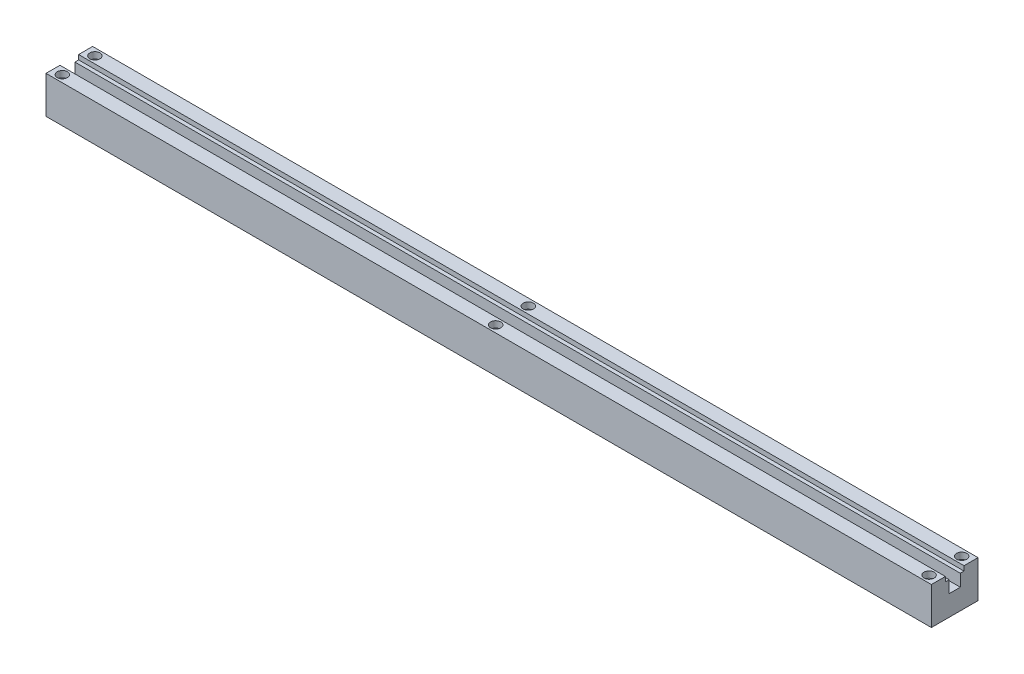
ISO-10303-21;
HEADER;
FILE_DESCRIPTION(('STEP AP214'),'2;1');
FILE_NAME('part.step','',(''),(''),'','','');
FILE_SCHEMA(('AUTOMOTIVE_DESIGN { 1 0 10303 214 1 1 1 1 }'));
ENDSEC;
DATA;
#1=APPLICATION_CONTEXT('core data for automotive mechanical design processes');
#2=APPLICATION_PROTOCOL_DEFINITION('international standard','automotive_design',2000,#1);
#3=PRODUCT_CONTEXT('',#1,'mechanical');
#4=PRODUCT('Part','Part','',(#3));
#5=PRODUCT_RELATED_PRODUCT_CATEGORY('part','',(#4));
#6=PRODUCT_DEFINITION_FORMATION('','',#4);
#7=PRODUCT_DEFINITION_CONTEXT('part definition',#1,'design');
#8=PRODUCT_DEFINITION('design','',#6,#7);
#9=PRODUCT_DEFINITION_SHAPE('','',#8);
#10=(LENGTH_UNIT() NAMED_UNIT(*) SI_UNIT(.MILLI.,.METRE.));
#11=(NAMED_UNIT(*) PLANE_ANGLE_UNIT() SI_UNIT($,.RADIAN.));
#12=(NAMED_UNIT(*) SI_UNIT($,.STERADIAN.) SOLID_ANGLE_UNIT());
#13=UNCERTAINTY_MEASURE_WITH_UNIT(LENGTH_MEASURE(1.E-05),#10,'distance_accuracy_value','');
#14=(GEOMETRIC_REPRESENTATION_CONTEXT(3) GLOBAL_UNCERTAINTY_ASSIGNED_CONTEXT((#13)) GLOBAL_UNIT_ASSIGNED_CONTEXT((#10,
#11,#12)) REPRESENTATION_CONTEXT('',''));
#15=CARTESIAN_POINT('',(0.,0.,0.));
#16=DIRECTION('',(0.,0.,1.));
#17=DIRECTION('',(1.,0.,0.));
#18=AXIS2_PLACEMENT_3D('',#15,#16,#17);
#19=CARTESIAN_POINT('',(10.,20.,17.5));
#20=DIRECTION('',(0.,1.,0.));
#21=DIRECTION('',(0.,0.,1.));
#22=AXIS2_PLACEMENT_3D('',#19,#20,#21);
#23=CYLINDRICAL_SURFACE('',#22,5.49999999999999);
#24=CARTESIAN_POINT('',(10.,13.2,17.5));
#25=DIRECTION('',(0.,1.,0.));
#26=DIRECTION('',(0.,0.,1.));
#27=AXIS2_PLACEMENT_3D('',#24,#25,#26);
#28=CIRCLE('',#27,5.49999999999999);
#29=CARTESIAN_POINT('',(10.,13.2,23.));
#30=VERTEX_POINT('',#29);
#31=EDGE_CURVE('E223',#30,#30,#28,.F.);
#32=ORIENTED_EDGE('',*,*,#31,.T.);
#33=EDGE_LOOP('',(#32));
#34=FACE_BOUND('',#33,.T.);
#35=CARTESIAN_POINT('',(10.,20.,17.5));
#36=DIRECTION('',(0.,1.,0.));
#37=DIRECTION('',(0.,0.,1.));
#38=AXIS2_PLACEMENT_3D('',#35,#36,#37);
#39=CIRCLE('',#38,5.49999999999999);
#40=CARTESIAN_POINT('',(10.,20.,23.));
#41=VERTEX_POINT('',#40);
#42=EDGE_CURVE('E158',#41,#41,#39,.T.);
#43=ORIENTED_EDGE('',*,*,#42,.T.);
#44=EDGE_LOOP('',(#43));
#45=FACE_BOUND('',#44,.T.);
#46=ADVANCED_FACE('F17',(#34,#45),#23,.F.);
#47=CARTESIAN_POINT('',(475.,20.,17.4999999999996));
#48=DIRECTION('',(0.,1.,0.));
#49=DIRECTION('',(0.,0.,1.));
#50=AXIS2_PLACEMENT_3D('',#47,#48,#49);
#51=CYLINDRICAL_SURFACE('',#50,5.50000000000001);
#52=CARTESIAN_POINT('',(475.,13.2,17.4999999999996));
#53=DIRECTION('',(0.,1.,0.));
#54=DIRECTION('',(0.,0.,1.));
#55=AXIS2_PLACEMENT_3D('',#52,#53,#54);
#56=CIRCLE('',#55,5.50000000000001);
#57=CARTESIAN_POINT('',(475.,13.2,22.9999999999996));
#58=VERTEX_POINT('',#57);
#59=EDGE_CURVE('E218',#58,#58,#56,.F.);
#60=ORIENTED_EDGE('',*,*,#59,.T.);
#61=EDGE_LOOP('',(#60));
#62=FACE_BOUND('',#61,.T.);
#63=CARTESIAN_POINT('',(475.,20.,17.4999999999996));
#64=DIRECTION('',(0.,1.,0.));
#65=DIRECTION('',(0.,0.,1.));
#66=AXIS2_PLACEMENT_3D('',#63,#64,#65);
#67=CIRCLE('',#66,5.50000000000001);
#68=CARTESIAN_POINT('',(475.,20.,22.9999999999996));
#69=VERTEX_POINT('',#68);
#70=EDGE_CURVE('E208',#69,#69,#67,.T.);
#71=ORIENTED_EDGE('',*,*,#70,.T.);
#72=EDGE_LOOP('',(#71));
#73=FACE_BOUND('',#72,.T.);
#74=ADVANCED_FACE('F325',(#62,#73),#51,.F.);
#75=CARTESIAN_POINT('',(940.,20.,17.5));
#76=DIRECTION('',(0.,1.,0.));
#77=DIRECTION('',(0.,0.,1.));
#78=AXIS2_PLACEMENT_3D('',#75,#76,#77);
#79=CYLINDRICAL_SURFACE('',#78,5.49999999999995);
#80=CARTESIAN_POINT('',(940.,13.2,17.5));
#81=DIRECTION('',(0.,1.,0.));
#82=DIRECTION('',(0.,0.,1.));
#83=AXIS2_PLACEMENT_3D('',#80,#81,#82);
#84=CIRCLE('',#83,5.49999999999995);
#85=CARTESIAN_POINT('',(940.,13.2,22.9999999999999));
#86=VERTEX_POINT('',#85);
#87=EDGE_CURVE('E215',#86,#86,#84,.F.);
#88=ORIENTED_EDGE('',*,*,#87,.T.);
#89=EDGE_LOOP('',(#88));
#90=FACE_BOUND('',#89,.T.);
#91=CARTESIAN_POINT('',(940.,20.,17.5));
#92=DIRECTION('',(0.,1.,0.));
#93=DIRECTION('',(0.,0.,1.));
#94=AXIS2_PLACEMENT_3D('',#91,#92,#93);
#95=CIRCLE('',#94,5.49999999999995);
#96=CARTESIAN_POINT('',(940.,20.,22.9999999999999));
#97=VERTEX_POINT('',#96);
#98=EDGE_CURVE('E154',#97,#97,#95,.T.);
#99=ORIENTED_EDGE('',*,*,#98,.T.);
#100=EDGE_LOOP('',(#99));
#101=FACE_BOUND('',#100,.T.);
#102=ADVANCED_FACE('F323',(#90,#101),#79,.F.);
#103=CARTESIAN_POINT('',(10.,20.,-17.5));
#104=DIRECTION('',(0.,1.,0.));
#105=DIRECTION('',(0.,0.,1.));
#106=AXIS2_PLACEMENT_3D('',#103,#104,#105);
#107=CYLINDRICAL_SURFACE('',#106,5.49999999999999);
#108=CARTESIAN_POINT('',(10.,13.2,-17.5));
#109=DIRECTION('',(0.,1.,0.));
#110=DIRECTION('',(0.,0.,1.));
#111=AXIS2_PLACEMENT_3D('',#108,#109,#110);
#112=CIRCLE('',#111,5.49999999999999);
#113=CARTESIAN_POINT('',(10.,13.2,-12.));
#114=VERTEX_POINT('',#113);
#115=EDGE_CURVE('E20',#114,#114,#112,.F.);
#116=ORIENTED_EDGE('',*,*,#115,.T.);
#117=EDGE_LOOP('',(#116));
#118=FACE_BOUND('',#117,.T.);
#119=CARTESIAN_POINT('',(10.,20.,-17.5));
#120=DIRECTION('',(0.,1.,0.));
#121=DIRECTION('',(0.,0.,1.));
#122=AXIS2_PLACEMENT_3D('',#119,#120,#121);
#123=CIRCLE('',#122,5.49999999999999);
#124=CARTESIAN_POINT('',(10.,20.,-12.));
#125=VERTEX_POINT('',#124);
#126=EDGE_CURVE('E153',#125,#125,#123,.T.);
#127=ORIENTED_EDGE('',*,*,#126,.T.);
#128=EDGE_LOOP('',(#127));
#129=FACE_BOUND('',#128,.T.);
#130=ADVANCED_FACE('F230',(#118,#129),#107,.F.);
#131=CARTESIAN_POINT('',(475.,20.,-17.5000000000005));
#132=DIRECTION('',(0.,1.,0.));
#133=DIRECTION('',(0.,0.,1.));
#134=AXIS2_PLACEMENT_3D('',#131,#132,#133);
#135=CYLINDRICAL_SURFACE('',#134,5.50000000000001);
#136=CARTESIAN_POINT('',(475.,13.2,-17.5000000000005));
#137=DIRECTION('',(0.,1.,0.));
#138=DIRECTION('',(0.,0.,1.));
#139=AXIS2_PLACEMENT_3D('',#136,#137,#138);
#140=CIRCLE('',#139,5.50000000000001);
#141=CARTESIAN_POINT('',(475.,13.2,-12.0000000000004));
#142=VERTEX_POINT('',#141);
#143=EDGE_CURVE('E221',#142,#142,#140,.F.);
#144=ORIENTED_EDGE('',*,*,#143,.T.);
#145=EDGE_LOOP('',(#144));
#146=FACE_BOUND('',#145,.T.);
#147=CARTESIAN_POINT('',(475.,20.,-17.5000000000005));
#148=DIRECTION('',(0.,1.,0.));
#149=DIRECTION('',(0.,0.,1.));
#150=AXIS2_PLACEMENT_3D('',#147,#148,#149);
#151=CIRCLE('',#150,5.50000000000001);
#152=CARTESIAN_POINT('',(475.,20.,-12.0000000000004));
#153=VERTEX_POINT('',#152);
#154=EDGE_CURVE('E201',#153,#153,#151,.T.);
#155=ORIENTED_EDGE('',*,*,#154,.T.);
#156=EDGE_LOOP('',(#155));
#157=FACE_BOUND('',#156,.T.);
#158=ADVANCED_FACE('F316',(#146,#157),#135,.F.);
#159=CARTESIAN_POINT('',(940.,20.,-17.5));
#160=DIRECTION('',(0.,1.,0.));
#161=DIRECTION('',(0.,0.,1.));
#162=AXIS2_PLACEMENT_3D('',#159,#160,#161);
#163=CYLINDRICAL_SURFACE('',#162,5.49999999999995);
#164=CARTESIAN_POINT('',(940.,13.2,-17.5));
#165=DIRECTION('',(0.,1.,0.));
#166=DIRECTION('',(0.,0.,1.));
#167=AXIS2_PLACEMENT_3D('',#164,#165,#166);
#168=CIRCLE('',#167,5.49999999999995);
#169=CARTESIAN_POINT('',(940.,13.2,-12.0000000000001));
#170=VERTEX_POINT('',#169);
#171=EDGE_CURVE('E162',#170,#170,#168,.F.);
#172=ORIENTED_EDGE('',*,*,#171,.T.);
#173=EDGE_LOOP('',(#172));
#174=FACE_BOUND('',#173,.T.);
#175=CARTESIAN_POINT('',(940.,20.,-17.5));
#176=DIRECTION('',(0.,1.,0.));
#177=DIRECTION('',(0.,0.,1.));
#178=AXIS2_PLACEMENT_3D('',#175,#176,#177);
#179=CIRCLE('',#178,5.49999999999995);
#180=CARTESIAN_POINT('',(940.,20.,-12.0000000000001));
#181=VERTEX_POINT('',#180);
#182=EDGE_CURVE('E149',#181,#181,#179,.T.);
#183=ORIENTED_EDGE('',*,*,#182,.T.);
#184=EDGE_LOOP('',(#183));
#185=FACE_BOUND('',#184,.T.);
#186=ADVANCED_FACE('F237',(#174,#185),#163,.F.);
#187=CARTESIAN_POINT('',(13.2,13.2,-17.5));
#188=DIRECTION('',(0.,-1.,0.));
#189=DIRECTION('',(0.,0.,-1.));
#190=AXIS2_PLACEMENT_3D('',#187,#188,#189);
#191=PLANE('',#190);
#192=ORIENTED_EDGE('',*,*,#115,.F.);
#193=EDGE_LOOP('',(#192));
#194=FACE_BOUND('',#193,.T.);
#195=CARTESIAN_POINT('',(10.,13.2,-17.5));
#196=DIRECTION('',(0.,1.,0.));
#197=DIRECTION('',(0.,0.,1.));
#198=AXIS2_PLACEMENT_3D('',#195,#196,#197);
#199=CIRCLE('',#198,3.2);
#200=CARTESIAN_POINT('',(10.,13.2,-14.3));
#201=VERTEX_POINT('',#200);
#202=EDGE_CURVE('E127',#201,#201,#199,.F.);
#203=ORIENTED_EDGE('',*,*,#202,.T.);
#204=EDGE_LOOP('',(#203));
#205=FACE_BOUND('',#204,.T.);
#206=ADVANCED_FACE('F233',(#194,#205),#191,.F.);
#207=CARTESIAN_POINT('',(13.2,13.2,17.5));
#208=DIRECTION('',(0.,-1.,0.));
#209=DIRECTION('',(0.,0.,-1.));
#210=AXIS2_PLACEMENT_3D('',#207,#208,#209);
#211=PLANE('',#210);
#212=ORIENTED_EDGE('',*,*,#31,.F.);
#213=EDGE_LOOP('',(#212));
#214=FACE_BOUND('',#213,.T.);
#215=CARTESIAN_POINT('',(10.,13.2,17.5));
#216=DIRECTION('',(0.,1.,0.));
#217=DIRECTION('',(0.,0.,1.));
#218=AXIS2_PLACEMENT_3D('',#215,#216,#217);
#219=CIRCLE('',#218,3.2);
#220=CARTESIAN_POINT('',(10.,13.2,20.7));
#221=VERTEX_POINT('',#220);
#222=EDGE_CURVE('E194',#221,#221,#219,.F.);
#223=ORIENTED_EDGE('',*,*,#222,.T.);
#224=EDGE_LOOP('',(#223));
#225=FACE_BOUND('',#224,.T.);
#226=ADVANCED_FACE('F236',(#214,#225),#211,.F.);
#227=CARTESIAN_POINT('',(478.2,13.2,-17.5000000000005));
#228=DIRECTION('',(0.,-1.,0.));
#229=DIRECTION('',(0.,0.,-1.));
#230=AXIS2_PLACEMENT_3D('',#227,#228,#229);
#231=PLANE('',#230);
#232=ORIENTED_EDGE('',*,*,#143,.F.);
#233=EDGE_LOOP('',(#232));
#234=FACE_BOUND('',#233,.T.);
#235=CARTESIAN_POINT('',(475.,13.2,-17.5000000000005));
#236=DIRECTION('',(0.,1.,0.));
#237=DIRECTION('',(0.,0.,1.));
#238=AXIS2_PLACEMENT_3D('',#235,#236,#237);
#239=CIRCLE('',#238,3.20000000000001);
#240=CARTESIAN_POINT('',(475.,13.2,-14.3000000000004));
#241=VERTEX_POINT('',#240);
#242=EDGE_CURVE('E191',#241,#241,#239,.F.);
#243=ORIENTED_EDGE('',*,*,#242,.T.);
#244=EDGE_LOOP('',(#243));
#245=FACE_BOUND('',#244,.T.);
#246=ADVANCED_FACE('F297',(#234,#245),#231,.F.);
#247=CARTESIAN_POINT('',(478.2,13.2,17.4999999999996));
#248=DIRECTION('',(0.,-1.,0.));
#249=DIRECTION('',(0.,0.,-1.));
#250=AXIS2_PLACEMENT_3D('',#247,#248,#249);
#251=PLANE('',#250);
#252=ORIENTED_EDGE('',*,*,#59,.F.);
#253=EDGE_LOOP('',(#252));
#254=FACE_BOUND('',#253,.T.);
#255=CARTESIAN_POINT('',(475.,13.2,17.4999999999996));
#256=DIRECTION('',(0.,1.,0.));
#257=DIRECTION('',(0.,0.,1.));
#258=AXIS2_PLACEMENT_3D('',#255,#256,#257);
#259=CIRCLE('',#258,3.20000000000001);
#260=CARTESIAN_POINT('',(475.,13.2,20.6999999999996));
#261=VERTEX_POINT('',#260);
#262=EDGE_CURVE('E188',#261,#261,#259,.F.);
#263=ORIENTED_EDGE('',*,*,#262,.T.);
#264=EDGE_LOOP('',(#263));
#265=FACE_BOUND('',#264,.T.);
#266=ADVANCED_FACE('F299',(#254,#265),#251,.F.);
#267=CARTESIAN_POINT('',(943.2,13.2,17.5));
#268=DIRECTION('',(0.,-1.,0.));
#269=DIRECTION('',(0.,0.,-1.));
#270=AXIS2_PLACEMENT_3D('',#267,#268,#269);
#271=PLANE('',#270);
#272=ORIENTED_EDGE('',*,*,#87,.F.);
#273=EDGE_LOOP('',(#272));
#274=FACE_BOUND('',#273,.T.);
#275=CARTESIAN_POINT('',(940.,13.2,17.5));
#276=DIRECTION('',(0.,1.,0.));
#277=DIRECTION('',(0.,0.,1.));
#278=AXIS2_PLACEMENT_3D('',#275,#276,#277);
#279=CIRCLE('',#278,3.19999999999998);
#280=CARTESIAN_POINT('',(940.,13.2,20.7));
#281=VERTEX_POINT('',#280);
#282=EDGE_CURVE('E185',#281,#281,#279,.F.);
#283=ORIENTED_EDGE('',*,*,#282,.T.);
#284=EDGE_LOOP('',(#283));
#285=FACE_BOUND('',#284,.T.);
#286=ADVANCED_FACE('F306',(#274,#285),#271,.F.);
#287=CARTESIAN_POINT('',(943.2,13.2,-17.5));
#288=DIRECTION('',(0.,-1.,0.));
#289=DIRECTION('',(0.,0.,-1.));
#290=AXIS2_PLACEMENT_3D('',#287,#288,#289);
#291=PLANE('',#290);
#292=ORIENTED_EDGE('',*,*,#171,.F.);
#293=EDGE_LOOP('',(#292));
#294=FACE_BOUND('',#293,.T.);
#295=CARTESIAN_POINT('',(940.,13.2,-17.5));
#296=DIRECTION('',(0.,1.,0.));
#297=DIRECTION('',(0.,0.,1.));
#298=AXIS2_PLACEMENT_3D('',#295,#296,#297);
#299=CIRCLE('',#298,3.19999999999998);
#300=CARTESIAN_POINT('',(940.,13.2,-14.3));
#301=VERTEX_POINT('',#300);
#302=EDGE_CURVE('E139',#301,#301,#299,.F.);
#303=ORIENTED_EDGE('',*,*,#302,.T.);
#304=EDGE_LOOP('',(#303));
#305=FACE_BOUND('',#304,.T.);
#306=ADVANCED_FACE('F364',(#294,#305),#291,.F.);
#307=CARTESIAN_POINT('',(0.,28.,6.));
#308=DIRECTION('',(0.,0.,1.));
#309=DIRECTION('',(1.,0.,0.));
#310=AXIS2_PLACEMENT_3D('',#307,#308,#309);
#311=PLANE('',#310);
#312=DIRECTION('',(1.,0.,0.));
#313=VECTOR('',#312,1.);
#314=CARTESIAN_POINT('',(0.,2.,6.));
#315=LINE('',#314,#313);
#316=CARTESIAN_POINT('',(950.,2.,6.));
#317=VERTEX_POINT('',#316);
#318=CARTESIAN_POINT('',(0.,2.,6.));
#319=VERTEX_POINT('',#318);
#320=EDGE_CURVE('E128',#317,#319,#315,.F.);
#321=ORIENTED_EDGE('',*,*,#320,.T.);
#322=DIRECTION('',(0.,1.,0.));
#323=VECTOR('',#322,1.);
#324=CARTESIAN_POINT('',(0.,0.,6.));
#325=LINE('',#324,#323);
#326=CARTESIAN_POINT('',(0.,15.,6.));
#327=VERTEX_POINT('',#326);
#328=EDGE_CURVE('E668',#319,#327,#325,.T.);
#329=ORIENTED_EDGE('',*,*,#328,.T.);
#330=DIRECTION('',(1.,0.,0.));
#331=VECTOR('',#330,1.);
#332=CARTESIAN_POINT('',(0.,15.,6.));
#333=LINE('',#332,#331);
#334=CARTESIAN_POINT('',(950.,15.,6.));
#335=VERTEX_POINT('',#334);
#336=EDGE_CURVE('E159',#327,#335,#333,.T.);
#337=ORIENTED_EDGE('',*,*,#336,.T.);
#338=DIRECTION('',(0.,1.,0.));
#339=VECTOR('',#338,1.);
#340=CARTESIAN_POINT('',(950.,0.,6.));
#341=LINE('',#340,#339);
#342=EDGE_CURVE('E132',#317,#335,#341,.T.);
#343=ORIENTED_EDGE('',*,*,#342,.F.);
#344=EDGE_LOOP('',(#321,#329,#337,#343));
#345=FACE_BOUND('',#344,.T.);
#346=ADVANCED_FACE('F360',(#345),#311,.F.);
#347=CARTESIAN_POINT('',(0.,15.,10.));
#348=DIRECTION('',(0.,-1.,0.));
#349=DIRECTION('',(0.,0.,-1.));
#350=AXIS2_PLACEMENT_3D('',#347,#348,#349);
#351=PLANE('',#350);
#352=ORIENTED_EDGE('',*,*,#336,.F.);
#353=DIRECTION('',(0.,0.,-1.));
#354=VECTOR('',#353,1.);
#355=CARTESIAN_POINT('',(0.,15.,0.));
#356=LINE('',#355,#354);
#357=CARTESIAN_POINT('',(0.,15.,10.));
#358=VERTEX_POINT('',#357);
#359=EDGE_CURVE('E634',#327,#358,#356,.F.);
#360=ORIENTED_EDGE('',*,*,#359,.T.);
#361=DIRECTION('',(1.,0.,0.));
#362=VECTOR('',#361,1.);
#363=CARTESIAN_POINT('',(0.,15.,10.));
#364=LINE('',#363,#362);
#365=CARTESIAN_POINT('',(950.,15.,10.));
#366=VERTEX_POINT('',#365);
#367=EDGE_CURVE('E155',#358,#366,#364,.T.);
#368=ORIENTED_EDGE('',*,*,#367,.T.);
#369=DIRECTION('',(0.,0.,-1.));
#370=VECTOR('',#369,1.);
#371=CARTESIAN_POINT('',(950.,15.,0.));
#372=LINE('',#371,#370);
#373=EDGE_CURVE('E134',#335,#366,#372,.F.);
#374=ORIENTED_EDGE('',*,*,#373,.F.);
#375=EDGE_LOOP('',(#352,#360,#368,#374));
#376=FACE_BOUND('',#375,.T.);
#377=ADVANCED_FACE('F352',(#376),#351,.F.);
#378=CARTESIAN_POINT('',(0.,25.,10.));
#379=DIRECTION('',(0.,0.,1.));
#380=DIRECTION('',(0.,-1.,0.));
#381=AXIS2_PLACEMENT_3D('',#378,#379,#380);
#382=PLANE('',#381);
#383=ORIENTED_EDGE('',*,*,#367,.F.);
#384=DIRECTION('',(0.,1.,0.));
#385=VECTOR('',#384,1.);
#386=CARTESIAN_POINT('',(0.,0.,10.));
#387=LINE('',#386,#385);
#388=CARTESIAN_POINT('',(0.,20.,10.));
#389=VERTEX_POINT('',#388);
#390=EDGE_CURVE('E638',#358,#389,#387,.T.);
#391=ORIENTED_EDGE('',*,*,#390,.T.);
#392=DIRECTION('',(1.,0.,0.));
#393=VECTOR('',#392,1.);
#394=CARTESIAN_POINT('',(950.,20.,10.));
#395=LINE('',#394,#393);
#396=CARTESIAN_POINT('',(950.,20.,10.));
#397=VERTEX_POINT('',#396);
#398=EDGE_CURVE('E150',#389,#397,#395,.T.);
#399=ORIENTED_EDGE('',*,*,#398,.T.);
#400=DIRECTION('',(0.,1.,0.));
#401=VECTOR('',#400,1.);
#402=CARTESIAN_POINT('',(950.,0.,10.));
#403=LINE('',#402,#401);
#404=EDGE_CURVE('E629',#366,#397,#403,.T.);
#405=ORIENTED_EDGE('',*,*,#404,.F.);
#406=EDGE_LOOP('',(#383,#391,#399,#405));
#407=FACE_BOUND('',#406,.T.);
#408=ADVANCED_FACE('F340',(#407),#382,.F.);
#409=CARTESIAN_POINT('',(950.,20.,25.));
#410=DIRECTION('',(0.,-1.,0.));
#411=DIRECTION('',(0.,0.,-1.));
#412=AXIS2_PLACEMENT_3D('',#409,#410,#411);
#413=PLANE('',#412);
#414=ORIENTED_EDGE('',*,*,#398,.F.);
#415=DIRECTION('',(0.,0.,-1.));
#416=VECTOR('',#415,1.);
#417=CARTESIAN_POINT('',(0.,20.,0.));
#418=LINE('',#417,#416);
#419=CARTESIAN_POINT('',(0.,20.,25.));
#420=VERTEX_POINT('',#419);
#421=EDGE_CURVE('E664',#389,#420,#418,.F.);
#422=ORIENTED_EDGE('',*,*,#421,.T.);
#423=DIRECTION('',(-1.,0.,0.));
#424=VECTOR('',#423,1.);
#425=CARTESIAN_POINT('',(950.,20.,25.));
#426=LINE('',#425,#424);
#427=CARTESIAN_POINT('',(950.,20.,25.));
#428=VERTEX_POINT('',#427);
#429=EDGE_CURVE('E117',#420,#428,#426,.F.);
#430=ORIENTED_EDGE('',*,*,#429,.T.);
#431=DIRECTION('',(0.,0.,-1.));
#432=VECTOR('',#431,1.);
#433=CARTESIAN_POINT('',(950.,20.,0.));
#434=LINE('',#433,#432);
#435=EDGE_CURVE('E627',#397,#428,#434,.F.);
#436=ORIENTED_EDGE('',*,*,#435,.F.);
#437=EDGE_LOOP('',(#414,#422,#430,#436));
#438=FACE_BOUND('',#437,.T.);
#439=ORIENTED_EDGE('',*,*,#98,.F.);
#440=EDGE_LOOP('',(#439));
#441=FACE_BOUND('',#440,.T.);
#442=ORIENTED_EDGE('',*,*,#70,.F.);
#443=EDGE_LOOP('',(#442));
#444=FACE_BOUND('',#443,.T.);
#445=ORIENTED_EDGE('',*,*,#42,.F.);
#446=EDGE_LOOP('',(#445));
#447=FACE_BOUND('',#446,.T.);
#448=ADVANCED_FACE('F336',(#438,#441,#444,#447),#413,.F.);
#449=CARTESIAN_POINT('',(950.,20.,25.));
#450=DIRECTION('',(0.,-1.,0.));
#451=DIRECTION('',(0.,0.,-1.));
#452=AXIS2_PLACEMENT_3D('',#449,#450,#451);
#453=PLANE('',#452);
#454=DIRECTION('',(-1.,0.,0.));
#455=VECTOR('',#454,1.);
#456=CARTESIAN_POINT('',(0.,20.,-10.));
#457=LINE('',#456,#455);
#458=CARTESIAN_POINT('',(0.,20.,-10.));
#459=VERTEX_POINT('',#458);
#460=CARTESIAN_POINT('',(950.,20.,-10.));
#461=VERTEX_POINT('',#460);
#462=EDGE_CURVE('E146',#459,#461,#457,.F.);
#463=ORIENTED_EDGE('',*,*,#462,.T.);
#464=DIRECTION('',(0.,0.,-1.));
#465=VECTOR('',#464,1.);
#466=CARTESIAN_POINT('',(950.,20.,0.));
#467=LINE('',#466,#465);
#468=CARTESIAN_POINT('',(950.,20.,-25.));
#469=VERTEX_POINT('',#468);
#470=EDGE_CURVE('E620',#469,#461,#467,.F.);
#471=ORIENTED_EDGE('',*,*,#470,.F.);
#472=DIRECTION('',(1.,0.,0.));
#473=VECTOR('',#472,1.);
#474=CARTESIAN_POINT('',(950.,20.,-25.));
#475=LINE('',#474,#473);
#476=CARTESIAN_POINT('',(0.,20.,-25.));
#477=VERTEX_POINT('',#476);
#478=EDGE_CURVE('E618',#469,#477,#475,.F.);
#479=ORIENTED_EDGE('',*,*,#478,.T.);
#480=DIRECTION('',(0.,0.,-1.));
#481=VECTOR('',#480,1.);
#482=CARTESIAN_POINT('',(0.,20.,0.));
#483=LINE('',#482,#481);
#484=EDGE_CURVE('E659',#477,#459,#483,.F.);
#485=ORIENTED_EDGE('',*,*,#484,.T.);
#486=EDGE_LOOP('',(#463,#471,#479,#485));
#487=FACE_BOUND('',#486,.T.);
#488=ORIENTED_EDGE('',*,*,#182,.F.);
#489=EDGE_LOOP('',(#488));
#490=FACE_BOUND('',#489,.T.);
#491=ORIENTED_EDGE('',*,*,#154,.F.);
#492=EDGE_LOOP('',(#491));
#493=FACE_BOUND('',#492,.T.);
#494=ORIENTED_EDGE('',*,*,#126,.F.);
#495=EDGE_LOOP('',(#494));
#496=FACE_BOUND('',#495,.T.);
#497=ADVANCED_FACE('F339',(#487,#490,#493,#496),#453,.F.);
#498=CARTESIAN_POINT('',(0.,25.,-10.));
#499=DIRECTION('',(0.,0.,-1.));
#500=DIRECTION('',(-1.,0.,0.));
#501=AXIS2_PLACEMENT_3D('',#498,#499,#500);
#502=PLANE('',#501);
#503=DIRECTION('',(1.,0.,0.));
#504=VECTOR('',#503,1.);
#505=CARTESIAN_POINT('',(0.,15.,-10.));
#506=LINE('',#505,#504);
#507=CARTESIAN_POINT('',(0.,15.,-10.));
#508=VERTEX_POINT('',#507);
#509=CARTESIAN_POINT('',(950.,15.,-10.));
#510=VERTEX_POINT('',#509);
#511=EDGE_CURVE('E143',#508,#510,#506,.T.);
#512=ORIENTED_EDGE('',*,*,#511,.T.);
#513=DIRECTION('',(0.,1.,0.));
#514=VECTOR('',#513,1.);
#515=CARTESIAN_POINT('',(950.,0.,-10.));
#516=LINE('',#515,#514);
#517=EDGE_CURVE('E611',#461,#510,#516,.F.);
#518=ORIENTED_EDGE('',*,*,#517,.F.);
#519=ORIENTED_EDGE('',*,*,#462,.F.);
#520=DIRECTION('',(0.,1.,0.));
#521=VECTOR('',#520,1.);
#522=CARTESIAN_POINT('',(0.,0.,-10.));
#523=LINE('',#522,#521);
#524=EDGE_CURVE('E613',#459,#508,#523,.F.);
#525=ORIENTED_EDGE('',*,*,#524,.T.);
#526=EDGE_LOOP('',(#512,#518,#519,#525));
#527=FACE_BOUND('',#526,.T.);
#528=ADVANCED_FACE('F349',(#527),#502,.F.);
#529=CARTESIAN_POINT('',(0.,15.,10.));
#530=DIRECTION('',(0.,-1.,0.));
#531=DIRECTION('',(0.,0.,-1.));
#532=AXIS2_PLACEMENT_3D('',#529,#530,#531);
#533=PLANE('',#532);
#534=DIRECTION('',(1.,0.,0.));
#535=VECTOR('',#534,1.);
#536=CARTESIAN_POINT('',(0.,15.,-6.));
#537=LINE('',#536,#535);
#538=CARTESIAN_POINT('',(0.,15.,-6.));
#539=VERTEX_POINT('',#538);
#540=CARTESIAN_POINT('',(950.,15.,-6.));
#541=VERTEX_POINT('',#540);
#542=EDGE_CURVE('E103',#539,#541,#537,.T.);
#543=ORIENTED_EDGE('',*,*,#542,.T.);
#544=DIRECTION('',(0.,0.,-1.));
#545=VECTOR('',#544,1.);
#546=CARTESIAN_POINT('',(950.,15.,0.));
#547=LINE('',#546,#545);
#548=EDGE_CURVE('E115',#510,#541,#547,.F.);
#549=ORIENTED_EDGE('',*,*,#548,.F.);
#550=ORIENTED_EDGE('',*,*,#511,.F.);
#551=DIRECTION('',(0.,0.,-1.));
#552=VECTOR('',#551,1.);
#553=CARTESIAN_POINT('',(0.,15.,0.));
#554=LINE('',#553,#552);
#555=EDGE_CURVE('E656',#508,#539,#554,.F.);
#556=ORIENTED_EDGE('',*,*,#555,.T.);
#557=EDGE_LOOP('',(#543,#549,#550,#556));
#558=FACE_BOUND('',#557,.T.);
#559=ADVANCED_FACE('F420',(#558),#533,.F.);
#560=CARTESIAN_POINT('',(0.,28.,-6.));
#561=DIRECTION('',(0.,0.,-1.));
#562=DIRECTION('',(0.,1.,0.));
#563=AXIS2_PLACEMENT_3D('',#560,#561,#562);
#564=PLANE('',#563);
#565=DIRECTION('',(1.,0.,0.));
#566=VECTOR('',#565,1.);
#567=CARTESIAN_POINT('',(0.,2.,-6.));
#568=LINE('',#567,#566);
#569=CARTESIAN_POINT('',(0.,2.,-6.));
#570=VERTEX_POINT('',#569);
#571=CARTESIAN_POINT('',(950.,2.,-6.));
#572=VERTEX_POINT('',#571);
#573=EDGE_CURVE('E120',#570,#572,#568,.T.);
#574=ORIENTED_EDGE('',*,*,#573,.T.);
#575=DIRECTION('',(0.,1.,0.));
#576=VECTOR('',#575,1.);
#577=CARTESIAN_POINT('',(950.,0.,-6.));
#578=LINE('',#577,#576);
#579=EDGE_CURVE('E109',#541,#572,#578,.F.);
#580=ORIENTED_EDGE('',*,*,#579,.F.);
#581=ORIENTED_EDGE('',*,*,#542,.F.);
#582=DIRECTION('',(0.,1.,0.));
#583=VECTOR('',#582,1.);
#584=CARTESIAN_POINT('',(0.,0.,-6.));
#585=LINE('',#584,#583);
#586=EDGE_CURVE('E123',#539,#570,#585,.F.);
#587=ORIENTED_EDGE('',*,*,#586,.T.);
#588=EDGE_LOOP('',(#574,#580,#581,#587));
#589=FACE_BOUND('',#588,.T.);
#590=ADVANCED_FACE('F121',(#589),#564,.F.);
#591=CARTESIAN_POINT('',(0.,2.,6.));
#592=DIRECTION('',(0.,-1.,0.));
#593=DIRECTION('',(0.,0.,-1.));
#594=AXIS2_PLACEMENT_3D('',#591,#592,#593);
#595=PLANE('',#594);
#596=ORIENTED_EDGE('',*,*,#573,.F.);
#597=DIRECTION('',(0.,0.,-1.));
#598=VECTOR('',#597,1.);
#599=CARTESIAN_POINT('',(0.,2.,0.));
#600=LINE('',#599,#598);
#601=EDGE_CURVE('E182',#570,#319,#600,.F.);
#602=ORIENTED_EDGE('',*,*,#601,.T.);
#603=ORIENTED_EDGE('',*,*,#320,.F.);
#604=DIRECTION('',(0.,0.,-1.));
#605=VECTOR('',#604,1.);
#606=CARTESIAN_POINT('',(950.,2.,0.));
#607=LINE('',#606,#605);
#608=EDGE_CURVE('E113',#572,#317,#607,.F.);
#609=ORIENTED_EDGE('',*,*,#608,.F.);
#610=EDGE_LOOP('',(#596,#602,#603,#609));
#611=FACE_BOUND('',#610,.T.);
#612=ADVANCED_FACE('F130',(#611),#595,.F.);
#613=CARTESIAN_POINT('',(10.,20.,-17.5));
#614=DIRECTION('',(0.,1.,0.));
#615=DIRECTION('',(0.,0.,1.));
#616=AXIS2_PLACEMENT_3D('',#613,#614,#615);
#617=CYLINDRICAL_SURFACE('',#616,3.2);
#618=CARTESIAN_POINT('',(10.,-20.,-17.5));
#619=DIRECTION('',(0.,1.,0.));
#620=DIRECTION('',(0.,0.,1.));
#621=AXIS2_PLACEMENT_3D('',#618,#619,#620);
#622=CIRCLE('',#621,3.2);
#623=CARTESIAN_POINT('',(10.,-20.,-14.3));
#624=VERTEX_POINT('',#623);
#625=EDGE_CURVE('E179',#624,#624,#622,.F.);
#626=ORIENTED_EDGE('',*,*,#625,.T.);
#627=EDGE_LOOP('',(#626));
#628=FACE_BOUND('',#627,.T.);
#629=ORIENTED_EDGE('',*,*,#202,.F.);
#630=EDGE_LOOP('',(#629));
#631=FACE_BOUND('',#630,.T.);
#632=ADVANCED_FACE('F241',(#628,#631),#617,.F.);
#633=CARTESIAN_POINT('',(10.,20.,17.5));
#634=DIRECTION('',(0.,1.,0.));
#635=DIRECTION('',(0.,0.,1.));
#636=AXIS2_PLACEMENT_3D('',#633,#634,#635);
#637=CYLINDRICAL_SURFACE('',#636,3.2);
#638=CARTESIAN_POINT('',(10.,-20.,17.5));
#639=DIRECTION('',(0.,1.,0.));
#640=DIRECTION('',(0.,0.,1.));
#641=AXIS2_PLACEMENT_3D('',#638,#639,#640);
#642=CIRCLE('',#641,3.2);
#643=CARTESIAN_POINT('',(10.,-20.,20.7));
#644=VERTEX_POINT('',#643);
#645=EDGE_CURVE('E176',#644,#644,#642,.F.);
#646=ORIENTED_EDGE('',*,*,#645,.T.);
#647=EDGE_LOOP('',(#646));
#648=FACE_BOUND('',#647,.T.);
#649=ORIENTED_EDGE('',*,*,#222,.F.);
#650=EDGE_LOOP('',(#649));
#651=FACE_BOUND('',#650,.T.);
#652=ADVANCED_FACE('F243',(#648,#651),#637,.F.);
#653=CARTESIAN_POINT('',(475.,20.,-17.5000000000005));
#654=DIRECTION('',(0.,1.,0.));
#655=DIRECTION('',(0.,0.,1.));
#656=AXIS2_PLACEMENT_3D('',#653,#654,#655);
#657=CYLINDRICAL_SURFACE('',#656,3.20000000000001);
#658=CARTESIAN_POINT('',(475.,-20.,-17.5000000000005));
#659=DIRECTION('',(0.,1.,0.));
#660=DIRECTION('',(0.,0.,1.));
#661=AXIS2_PLACEMENT_3D('',#658,#659,#660);
#662=CIRCLE('',#661,3.20000000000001);
#663=CARTESIAN_POINT('',(475.,-20.,-14.3000000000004));
#664=VERTEX_POINT('',#663);
#665=EDGE_CURVE('E173',#664,#664,#662,.F.);
#666=ORIENTED_EDGE('',*,*,#665,.T.);
#667=EDGE_LOOP('',(#666));
#668=FACE_BOUND('',#667,.T.);
#669=ORIENTED_EDGE('',*,*,#242,.F.);
#670=EDGE_LOOP('',(#669));
#671=FACE_BOUND('',#670,.T.);
#672=ADVANCED_FACE('F251',(#668,#671),#657,.F.);
#673=CARTESIAN_POINT('',(475.,20.,17.4999999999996));
#674=DIRECTION('',(0.,1.,0.));
#675=DIRECTION('',(0.,0.,1.));
#676=AXIS2_PLACEMENT_3D('',#673,#674,#675);
#677=CYLINDRICAL_SURFACE('',#676,3.20000000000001);
#678=CARTESIAN_POINT('',(475.,-20.,17.4999999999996));
#679=DIRECTION('',(0.,1.,0.));
#680=DIRECTION('',(0.,0.,1.));
#681=AXIS2_PLACEMENT_3D('',#678,#679,#680);
#682=CIRCLE('',#681,3.20000000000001);
#683=CARTESIAN_POINT('',(475.,-20.,20.6999999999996));
#684=VERTEX_POINT('',#683);
#685=EDGE_CURVE('E170',#684,#684,#682,.F.);
#686=ORIENTED_EDGE('',*,*,#685,.T.);
#687=EDGE_LOOP('',(#686));
#688=FACE_BOUND('',#687,.T.);
#689=ORIENTED_EDGE('',*,*,#262,.F.);
#690=EDGE_LOOP('',(#689));
#691=FACE_BOUND('',#690,.T.);
#692=ADVANCED_FACE('F284',(#688,#691),#677,.F.);
#693=CARTESIAN_POINT('',(940.,20.,17.5));
#694=DIRECTION('',(0.,1.,0.));
#695=DIRECTION('',(0.,0.,1.));
#696=AXIS2_PLACEMENT_3D('',#693,#694,#695);
#697=CYLINDRICAL_SURFACE('',#696,3.19999999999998);
#698=CARTESIAN_POINT('',(940.,-20.,17.5));
#699=DIRECTION('',(0.,1.,0.));
#700=DIRECTION('',(0.,0.,1.));
#701=AXIS2_PLACEMENT_3D('',#698,#699,#700);
#702=CIRCLE('',#701,3.19999999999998);
#703=CARTESIAN_POINT('',(940.,-20.,20.7));
#704=VERTEX_POINT('',#703);
#705=EDGE_CURVE('E167',#704,#704,#702,.F.);
#706=ORIENTED_EDGE('',*,*,#705,.T.);
#707=EDGE_LOOP('',(#706));
#708=FACE_BOUND('',#707,.T.);
#709=ORIENTED_EDGE('',*,*,#282,.F.);
#710=EDGE_LOOP('',(#709));
#711=FACE_BOUND('',#710,.T.);
#712=ADVANCED_FACE('F280',(#708,#711),#697,.F.);
#713=CARTESIAN_POINT('',(940.,20.,-17.5));
#714=DIRECTION('',(0.,1.,0.));
#715=DIRECTION('',(0.,0.,1.));
#716=AXIS2_PLACEMENT_3D('',#713,#714,#715);
#717=CYLINDRICAL_SURFACE('',#716,3.19999999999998);
#718=CARTESIAN_POINT('',(940.,-20.,-17.5));
#719=DIRECTION('',(0.,1.,0.));
#720=DIRECTION('',(0.,0.,1.));
#721=AXIS2_PLACEMENT_3D('',#718,#719,#720);
#722=CIRCLE('',#721,3.19999999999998);
#723=CARTESIAN_POINT('',(940.,-20.,-14.3));
#724=VERTEX_POINT('',#723);
#725=EDGE_CURVE('E163',#724,#724,#722,.F.);
#726=ORIENTED_EDGE('',*,*,#725,.T.);
#727=EDGE_LOOP('',(#726));
#728=FACE_BOUND('',#727,.T.);
#729=ORIENTED_EDGE('',*,*,#302,.F.);
#730=EDGE_LOOP('',(#729));
#731=FACE_BOUND('',#730,.T.);
#732=ADVANCED_FACE('F276',(#728,#731),#717,.F.);
#733=CARTESIAN_POINT('',(950.,20.,25.));
#734=DIRECTION('',(0.,0.,-1.));
#735=DIRECTION('',(-1.,0.,0.));
#736=AXIS2_PLACEMENT_3D('',#733,#734,#735);
#737=PLANE('',#736);
#738=DIRECTION('',(1.,0.,0.));
#739=VECTOR('',#738,1.);
#740=CARTESIAN_POINT('',(950.,-20.,25.));
#741=LINE('',#740,#739);
#742=CARTESIAN_POINT('',(0.,-20.,25.));
#743=VERTEX_POINT('',#742);
#744=CARTESIAN_POINT('',(950.,-20.,25.));
#745=VERTEX_POINT('',#744);
#746=EDGE_CURVE('E166',#743,#745,#741,.T.);
#747=ORIENTED_EDGE('',*,*,#746,.T.);
#748=DIRECTION('',(0.,1.,0.));
#749=VECTOR('',#748,1.);
#750=CARTESIAN_POINT('',(950.,0.,25.));
#751=LINE('',#750,#749);
#752=EDGE_CURVE('E625',#428,#745,#751,.F.);
#753=ORIENTED_EDGE('',*,*,#752,.F.);
#754=ORIENTED_EDGE('',*,*,#429,.F.);
#755=DIRECTION('',(0.,1.,0.));
#756=VECTOR('',#755,1.);
#757=CARTESIAN_POINT('',(0.,0.,25.));
#758=LINE('',#757,#756);
#759=EDGE_CURVE('E650',#420,#743,#758,.F.);
#760=ORIENTED_EDGE('',*,*,#759,.T.);
#761=EDGE_LOOP('',(#747,#753,#754,#760));
#762=FACE_BOUND('',#761,.T.);
#763=ADVANCED_FACE('F273',(#762),#737,.F.);
#764=CARTESIAN_POINT('',(950.,0.,0.));
#765=DIRECTION('',(1.,0.,0.));
#766=DIRECTION('',(0.,0.,-1.));
#767=AXIS2_PLACEMENT_3D('',#764,#765,#766);
#768=PLANE('',#767);
#769=ORIENTED_EDGE('',*,*,#517,.T.);
#770=ORIENTED_EDGE('',*,*,#548,.T.);
#771=ORIENTED_EDGE('',*,*,#579,.T.);
#772=ORIENTED_EDGE('',*,*,#608,.T.);
#773=ORIENTED_EDGE('',*,*,#342,.T.);
#774=ORIENTED_EDGE('',*,*,#373,.T.);
#775=ORIENTED_EDGE('',*,*,#404,.T.);
#776=ORIENTED_EDGE('',*,*,#435,.T.);
#777=ORIENTED_EDGE('',*,*,#752,.T.);
#778=DIRECTION('',(0.,0.,1.));
#779=VECTOR('',#778,1.);
#780=CARTESIAN_POINT('',(950.,-20.,25.));
#781=LINE('',#780,#779);
#782=CARTESIAN_POINT('',(950.,-20.,-25.));
#783=VERTEX_POINT('',#782);
#784=EDGE_CURVE('E644',#745,#783,#781,.F.);
#785=ORIENTED_EDGE('',*,*,#784,.T.);
#786=DIRECTION('',(0.,1.,0.));
#787=VECTOR('',#786,1.);
#788=CARTESIAN_POINT('',(950.,20.,-25.));
#789=LINE('',#788,#787);
#790=EDGE_CURVE('E615',#783,#469,#789,.T.);
#791=ORIENTED_EDGE('',*,*,#790,.T.);
#792=ORIENTED_EDGE('',*,*,#470,.T.);
#793=EDGE_LOOP('',(#769,#770,#771,#772,#773,#774,#775,#776,#777,#785,#791,#792));
#794=FACE_BOUND('',#793,.T.);
#795=ADVANCED_FACE('F111',(#794),#768,.T.);
#796=CARTESIAN_POINT('',(950.,20.,-25.));
#797=DIRECTION('',(0.,0.,1.));
#798=DIRECTION('',(1.,0.,0.));
#799=AXIS2_PLACEMENT_3D('',#796,#797,#798);
#800=PLANE('',#799);
#801=ORIENTED_EDGE('',*,*,#478,.F.);
#802=ORIENTED_EDGE('',*,*,#790,.F.);
#803=DIRECTION('',(1.,0.,0.));
#804=VECTOR('',#803,1.);
#805=CARTESIAN_POINT('',(950.,-20.,-25.));
#806=LINE('',#805,#804);
#807=CARTESIAN_POINT('',(0.,-20.,-25.));
#808=VERTEX_POINT('',#807);
#809=EDGE_CURVE('E26',#783,#808,#806,.F.);
#810=ORIENTED_EDGE('',*,*,#809,.T.);
#811=DIRECTION('',(0.,1.,0.));
#812=VECTOR('',#811,1.);
#813=CARTESIAN_POINT('',(0.,0.,-25.));
#814=LINE('',#813,#812);
#815=EDGE_CURVE('E34',#808,#477,#814,.T.);
#816=ORIENTED_EDGE('',*,*,#815,.T.);
#817=EDGE_LOOP('',(#801,#802,#810,#816));
#818=FACE_BOUND('',#817,.T.);
#819=ADVANCED_FACE('F263',(#818),#800,.F.);
#820=CARTESIAN_POINT('',(0.,0.,0.));
#821=DIRECTION('',(1.,0.,0.));
#822=DIRECTION('',(0.,0.,-1.));
#823=AXIS2_PLACEMENT_3D('',#820,#821,#822);
#824=PLANE('',#823);
#825=ORIENTED_EDGE('',*,*,#586,.F.);
#826=ORIENTED_EDGE('',*,*,#555,.F.);
#827=ORIENTED_EDGE('',*,*,#524,.F.);
#828=ORIENTED_EDGE('',*,*,#484,.F.);
#829=ORIENTED_EDGE('',*,*,#815,.F.);
#830=DIRECTION('',(0.,0.,1.));
#831=VECTOR('',#830,1.);
#832=CARTESIAN_POINT('',(0.,-20.,25.));
#833=LINE('',#832,#831);
#834=EDGE_CURVE('E11',#808,#743,#833,.T.);
#835=ORIENTED_EDGE('',*,*,#834,.T.);
#836=ORIENTED_EDGE('',*,*,#759,.F.);
#837=ORIENTED_EDGE('',*,*,#421,.F.);
#838=ORIENTED_EDGE('',*,*,#390,.F.);
#839=ORIENTED_EDGE('',*,*,#359,.F.);
#840=ORIENTED_EDGE('',*,*,#328,.F.);
#841=ORIENTED_EDGE('',*,*,#601,.F.);
#842=EDGE_LOOP('',(#825,#826,#827,#828,#829,#835,#836,#837,#838,#839,#840,#841));
#843=FACE_BOUND('',#842,.T.);
#844=ADVANCED_FACE('F257',(#843),#824,.F.);
#845=CARTESIAN_POINT('',(950.,-20.,25.));
#846=DIRECTION('',(0.,1.,0.));
#847=DIRECTION('',(0.,0.,1.));
#848=AXIS2_PLACEMENT_3D('',#845,#846,#847);
#849=PLANE('',#848);
#850=ORIENTED_EDGE('',*,*,#809,.F.);
#851=ORIENTED_EDGE('',*,*,#784,.F.);
#852=ORIENTED_EDGE('',*,*,#746,.F.);
#853=ORIENTED_EDGE('',*,*,#834,.F.);
#854=EDGE_LOOP('',(#850,#851,#852,#853));
#855=FACE_BOUND('',#854,.T.);
#856=ORIENTED_EDGE('',*,*,#725,.F.);
#857=EDGE_LOOP('',(#856));
#858=FACE_BOUND('',#857,.T.);
#859=ORIENTED_EDGE('',*,*,#705,.F.);
#860=EDGE_LOOP('',(#859));
#861=FACE_BOUND('',#860,.T.);
#862=ORIENTED_EDGE('',*,*,#685,.F.);
#863=EDGE_LOOP('',(#862));
#864=FACE_BOUND('',#863,.T.);
#865=ORIENTED_EDGE('',*,*,#665,.F.);
#866=EDGE_LOOP('',(#865));
#867=FACE_BOUND('',#866,.T.);
#868=ORIENTED_EDGE('',*,*,#645,.F.);
#869=EDGE_LOOP('',(#868));
#870=FACE_BOUND('',#869,.T.);
#871=ORIENTED_EDGE('',*,*,#625,.F.);
#872=EDGE_LOOP('',(#871));
#873=FACE_BOUND('',#872,.T.);
#874=ADVANCED_FACE('F255',(#855,#858,#861,#864,#867,#870,#873),#849,.F.);
#875=CLOSED_SHELL('',(#46,#74,#102,#130,#158,#186,#206,#226,#246,#266,#286,#306,#346,#377,#408,
#448,#497,#528,#559,#590,#612,#632,#652,#672,#692,#712,#732,#763,#795,#819,#844,#874));
#876=MANIFOLD_SOLID_BREP('B1',#875);
#877=ADVANCED_BREP_SHAPE_REPRESENTATION('',(#18,#876),#14);
#878=SHAPE_DEFINITION_REPRESENTATION(#9,#877);
ENDSEC;
END-ISO-10303-21;
